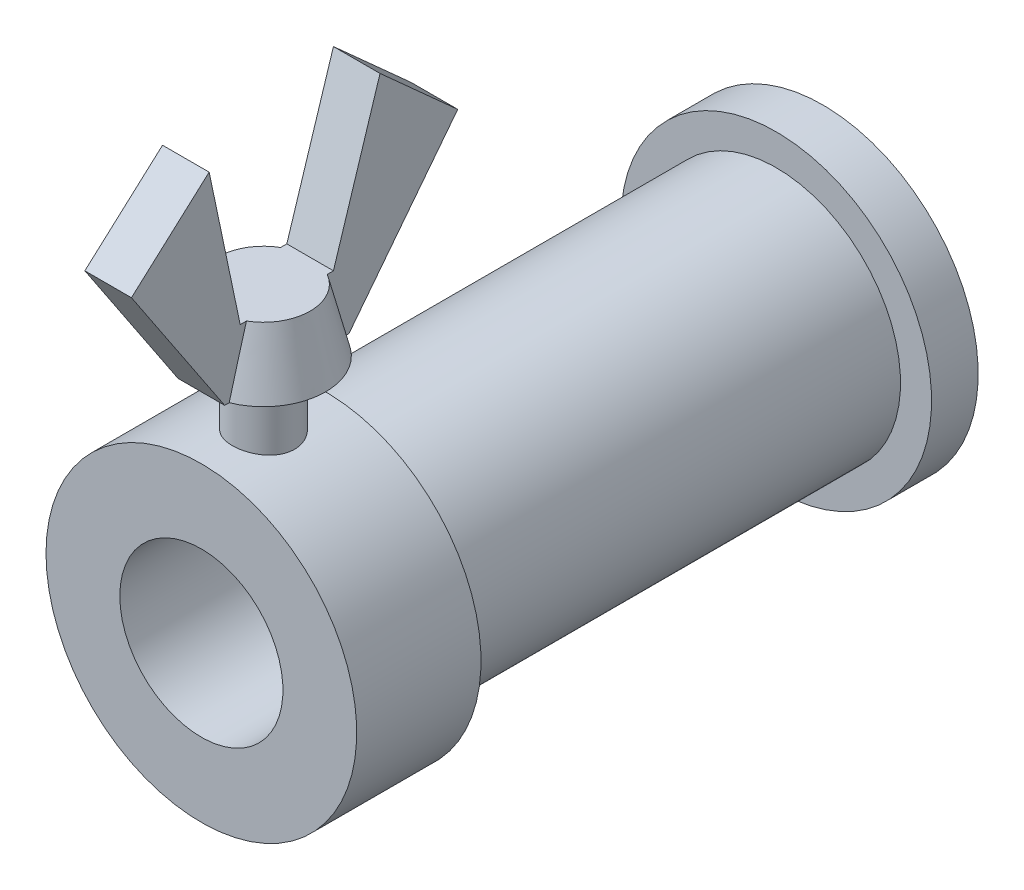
ISO-10303-21;
HEADER;
FILE_DESCRIPTION(('STEP AP214'),'2;1');
FILE_NAME('part.step','',(''),(''),'','','');
FILE_SCHEMA(('AUTOMOTIVE_DESIGN { 1 0 10303 214 1 1 1 1 }'));
ENDSEC;
DATA;
#1=APPLICATION_CONTEXT('core data for automotive mechanical design processes');
#2=APPLICATION_PROTOCOL_DEFINITION('international standard','automotive_design',2000,#1);
#3=PRODUCT_CONTEXT('',#1,'mechanical');
#4=PRODUCT('Part','Part','',(#3));
#5=PRODUCT_RELATED_PRODUCT_CATEGORY('part','',(#4));
#6=PRODUCT_DEFINITION_FORMATION('','',#4);
#7=PRODUCT_DEFINITION_CONTEXT('part definition',#1,'design');
#8=PRODUCT_DEFINITION('design','',#6,#7);
#9=PRODUCT_DEFINITION_SHAPE('','',#8);
#10=(LENGTH_UNIT() NAMED_UNIT(*) SI_UNIT(.MILLI.,.METRE.));
#11=(NAMED_UNIT(*) PLANE_ANGLE_UNIT() SI_UNIT($,.RADIAN.));
#12=(NAMED_UNIT(*) SI_UNIT($,.STERADIAN.) SOLID_ANGLE_UNIT());
#13=UNCERTAINTY_MEASURE_WITH_UNIT(LENGTH_MEASURE(1.E-05),#10,'distance_accuracy_value','');
#14=(GEOMETRIC_REPRESENTATION_CONTEXT(3) GLOBAL_UNCERTAINTY_ASSIGNED_CONTEXT((#13)) GLOBAL_UNIT_ASSIGNED_CONTEXT((#10,
#11,#12)) REPRESENTATION_CONTEXT('',''));
#15=CARTESIAN_POINT('',(0.,0.,0.));
#16=DIRECTION('',(0.,0.,1.));
#17=DIRECTION('',(1.,0.,0.));
#18=AXIS2_PLACEMENT_3D('',#15,#16,#17);
#19=CARTESIAN_POINT('',(0.,18.,36.));
#20=DIRECTION('',(0.,-1.,0.));
#21=DIRECTION('',(0.,0.,1.));
#22=AXIS2_PLACEMENT_3D('',#19,#20,#21);
#23=CONICAL_SURFACE('',#22,3.,0.244978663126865);
#24=CARTESIAN_POINT('',(-1.5,20.8634565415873,37.7225784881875));
#25=CARTESIAN_POINT('',(-1.5,20.7179564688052,37.7707943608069));
#26=CARTESIAN_POINT('',(-1.5,20.5722086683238,37.8182542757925));
#27=CARTESIAN_POINT('',(-1.5,20.2803109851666,37.9119099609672));
#28=CARTESIAN_POINT('',(-1.5,20.13416111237,37.9581057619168));
#29=CARTESIAN_POINT('',(-1.5,19.8415562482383,38.0494799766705));
#30=CARTESIAN_POINT('',(-1.5,19.6951012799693,38.0946584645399));
#31=CARTESIAN_POINT('',(-1.5,19.401932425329,38.1841702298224));
#32=CARTESIAN_POINT('',(-1.5,19.2552185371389,38.2285035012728));
#33=CARTESIAN_POINT('',(-1.5,18.8148083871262,38.3604319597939));
#34=CARTESIAN_POINT('',(-1.5,18.5207956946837,38.4469706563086));
#35=CARTESIAN_POINT('',(-1.5,17.9321710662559,38.617999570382));
#36=CARTESIAN_POINT('',(-1.5,17.6375591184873,38.7024897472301));
#37=CARTESIAN_POINT('',(-1.5,17.1572394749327,38.8388644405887));
#38=CARTESIAN_POINT('',(-1.5,16.9716653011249,38.8912200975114));
#39=CARTESIAN_POINT('',(-1.5,16.6003702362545,38.995403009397));
#40=CARTESIAN_POINT('',(-1.5,16.4146493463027,39.0472302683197));
#41=CARTESIAN_POINT('',(-1.5,15.8572788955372,39.2020403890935));
#42=CARTESIAN_POINT('',(-1.5,15.4854412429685,39.3043460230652));
#43=CARTESIAN_POINT('',(-1.5,14.6318117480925,39.5375328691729));
#44=CARTESIAN_POINT('',(-1.5,14.1498946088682,39.6679546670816));
#45=CARTESIAN_POINT('',(-1.5,13.1856155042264,39.9271461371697));
#46=CARTESIAN_POINT('',(-1.5,12.7032535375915,40.0559158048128));
#47=CARTESIAN_POINT('',(-1.5,11.7382755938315,40.3121964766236));
#48=CARTESIAN_POINT('',(-1.5,11.2556596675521,40.439707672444));
#49=CARTESIAN_POINT('',(-1.5,10.2901756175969,40.6937568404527));
#50=CARTESIAN_POINT('',(-1.5,9.80730749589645,40.8202948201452));
#51=CARTESIAN_POINT('',(-1.5,9.32434773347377,40.9464797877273));
#52=B_SPLINE_CURVE_WITH_KNOTS('',3,(#24,#25,#26,#27,#28,#29,#30,#31,#32,#33,#34,#35,#36,#37,#38,
#39,#40,#41,#42,#43,#44,#45,#46,#47,#48,#49,#50,#51),.UNSPECIFIED.,.F.,.F.,(4,2,2,2,2,2,2,2,2,2,
2,2,2,4),(0.,0.459836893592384,0.919662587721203,1.37945469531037,1.83925004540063,
2.75869016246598,3.67814853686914,4.25660258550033,4.83505229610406,5.99201310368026,
7.4897692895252,8.9875295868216,10.4850581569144,11.982575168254),.UNSPECIFIED.);
#53=CARTESIAN_POINT('',(-1.5,18.,38.5980762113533));
#54=VERTEX_POINT('',#53);
#55=CARTESIAN_POINT('',(-1.5,14.,39.7080992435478));
#56=VERTEX_POINT('',#55);
#57=EDGE_CURVE('E308',#54,#56,#52,.T.);
#58=ORIENTED_EDGE('',*,*,#57,.F.);
#59=CARTESIAN_POINT('',(0.,18.,36.));
#60=DIRECTION('',(0.,-1.,0.));
#61=DIRECTION('',(0.,0.,1.));
#62=AXIS2_PLACEMENT_3D('',#59,#60,#61);
#63=CIRCLE('',#62,3.);
#64=CARTESIAN_POINT('',(-1.5,18.,33.4019237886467));
#65=VERTEX_POINT('',#64);
#66=EDGE_CURVE('E176',#54,#65,#63,.T.);
#67=ORIENTED_EDGE('',*,*,#66,.T.);
#68=CARTESIAN_POINT('',(-1.5,9.32434773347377,31.0535202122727));
#69=CARTESIAN_POINT('',(-1.5,9.80738804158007,31.1797262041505));
#70=CARTESIAN_POINT('',(-1.5,10.2903366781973,31.3062853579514));
#71=CARTESIAN_POINT('',(-1.5,11.2559717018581,31.5603746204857));
#72=CARTESIAN_POINT('',(-1.5,11.7386580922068,31.6879047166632));
#73=CARTESIAN_POINT('',(-1.5,12.7036262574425,31.9441835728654));
#74=CARTESIAN_POINT('',(-1.5,13.1859080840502,32.0729321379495));
#75=CARTESIAN_POINT('',(-1.5,14.1500361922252,32.3320837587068));
#76=CARTESIAN_POINT('',(-1.5,14.6318824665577,32.4624868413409));
#77=CARTESIAN_POINT('',(-1.5,15.5950544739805,32.7255967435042));
#78=CARTESIAN_POINT('',(-1.5,16.0763800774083,32.8583040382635));
#79=CARTESIAN_POINT('',(-1.5,17.038107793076,33.12697047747));
#80=CARTESIAN_POINT('',(-1.5,17.5185099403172,33.2629294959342));
#81=CARTESIAN_POINT('',(-1.5,18.2380729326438,33.4706495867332));
#82=CARTESIAN_POINT('',(-1.5,18.4777770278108,33.5405268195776));
#83=CARTESIAN_POINT('',(-1.5,18.9567027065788,33.6819038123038));
#84=CARTESIAN_POINT('',(-1.5,19.1959242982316,33.7534035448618));
#85=CARTESIAN_POINT('',(-1.5,19.6737573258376,33.898533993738));
#86=CARTESIAN_POINT('',(-1.5,19.9123686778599,33.972164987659));
#87=CARTESIAN_POINT('',(-1.5,20.2696087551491,34.0847837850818));
#88=CARTESIAN_POINT('',(-1.5,20.3885793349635,34.1226865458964));
#89=CARTESIAN_POINT('',(-1.5,20.62624120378,34.199363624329));
#90=CARTESIAN_POINT('',(-1.5,20.7449324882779,34.2381379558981));
#91=CARTESIAN_POINT('',(-1.5,20.8634565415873,34.2774215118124));
#92=B_SPLINE_CURVE_WITH_KNOTS('',3,(#68,#69,#70,#71,#72,#73,#74,#75,#76,#77,#78,#79,#80,#81,#82,
#83,#84,#85,#86,#87,#88,#89,#90,#91),.UNSPECIFIED.,.F.,.F.,(4,2,2,2,2,2,2,2,2,2,2,4),(0.,
1.49776676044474,2.99551418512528,4.49302590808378,5.99056206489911,7.48841083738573,
8.98620167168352,9.73524200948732,10.4842697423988,11.2333954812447,11.6079796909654,
11.9825699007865),.UNSPECIFIED.);
#93=CARTESIAN_POINT('',(-1.5,14.,32.2919007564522));
#94=VERTEX_POINT('',#93);
#95=EDGE_CURVE('E205',#94,#65,#92,.T.);
#96=ORIENTED_EDGE('',*,*,#95,.F.);
#97=CARTESIAN_POINT('',(0.,14.,36.));
#98=DIRECTION('',(0.,-1.,0.));
#99=DIRECTION('',(0.,0.,1.));
#100=AXIS2_PLACEMENT_3D('',#97,#98,#99);
#101=CIRCLE('',#100,4.);
#102=EDGE_CURVE('E174',#56,#94,#101,.T.);
#103=ORIENTED_EDGE('',*,*,#102,.F.);
#104=EDGE_LOOP('',(#58,#67,#96,#103));
#105=FACE_BOUND('',#104,.T.);
#106=ADVANCED_FACE('F14',(#105),#23,.T.);
#107=CARTESIAN_POINT('',(-10.,0.,0.));
#108=DIRECTION('',(0.,0.,1.));
#109=DIRECTION('',(1.,0.,0.));
#110=AXIS2_PLACEMENT_3D('',#107,#108,#109);
#111=PLANE('',#110);
#112=CARTESIAN_POINT('',(0.,0.,0.));
#113=DIRECTION('',(0.,0.,-1.));
#114=DIRECTION('',(-1.,0.,0.));
#115=AXIS2_PLACEMENT_3D('',#112,#113,#114);
#116=CIRCLE('',#115,5.25);
#117=CARTESIAN_POINT('',(-5.25,0.,0.));
#118=VERTEX_POINT('',#117);
#119=EDGE_CURVE('E181',#118,#118,#116,.T.);
#120=ORIENTED_EDGE('',*,*,#119,.F.);
#121=EDGE_LOOP('',(#120));
#122=FACE_BOUND('',#121,.T.);
#123=CARTESIAN_POINT('',(0.,0.,0.));
#124=DIRECTION('',(0.,0.,-1.));
#125=DIRECTION('',(-1.,0.,0.));
#126=AXIS2_PLACEMENT_3D('',#123,#124,#125);
#127=CIRCLE('',#126,10.);
#128=CARTESIAN_POINT('',(-10.,0.,0.));
#129=VERTEX_POINT('',#128);
#130=EDGE_CURVE('E202',#129,#129,#127,.T.);
#131=ORIENTED_EDGE('',*,*,#130,.T.);
#132=EDGE_LOOP('',(#131));
#133=FACE_BOUND('',#132,.T.);
#134=ADVANCED_FACE('F16',(#122,#133),#111,.F.);
#135=CARTESIAN_POINT('',(0.,0.,-20.));
#136=DIRECTION('',(0.,0.,-1.));
#137=DIRECTION('',(-1.,0.,0.));
#138=AXIS2_PLACEMENT_3D('',#135,#136,#137);
#139=CYLINDRICAL_SURFACE('',#138,10.);
#140=ORIENTED_EDGE('',*,*,#130,.F.);
#141=EDGE_LOOP('',(#140));
#142=FACE_BOUND('',#141,.T.);
#143=CARTESIAN_POINT('',(0.,0.,3.));
#144=DIRECTION('',(0.,0.,-1.));
#145=DIRECTION('',(-1.,0.,0.));
#146=AXIS2_PLACEMENT_3D('',#143,#144,#145);
#147=CIRCLE('',#146,10.);
#148=CARTESIAN_POINT('',(-10.,0.,3.));
#149=VERTEX_POINT('',#148);
#150=EDGE_CURVE('E199',#149,#149,#147,.T.);
#151=ORIENTED_EDGE('',*,*,#150,.T.);
#152=EDGE_LOOP('',(#151));
#153=FACE_BOUND('',#152,.T.);
#154=ADVANCED_FACE('F254',(#142,#153),#139,.T.);
#155=CARTESIAN_POINT('',(-8.,0.,3.));
#156=DIRECTION('',(0.,0.,-1.));
#157=DIRECTION('',(-1.,0.,0.));
#158=AXIS2_PLACEMENT_3D('',#155,#156,#157);
#159=PLANE('',#158);
#160=ORIENTED_EDGE('',*,*,#150,.F.);
#161=EDGE_LOOP('',(#160));
#162=FACE_BOUND('',#161,.T.);
#163=CARTESIAN_POINT('',(0.,0.,3.));
#164=DIRECTION('',(0.,0.,-1.));
#165=DIRECTION('',(-1.,0.,0.));
#166=AXIS2_PLACEMENT_3D('',#163,#164,#165);
#167=CIRCLE('',#166,8.);
#168=CARTESIAN_POINT('',(-8.,0.,3.));
#169=VERTEX_POINT('',#168);
#170=EDGE_CURVE('E196',#169,#169,#167,.T.);
#171=ORIENTED_EDGE('',*,*,#170,.T.);
#172=EDGE_LOOP('',(#171));
#173=FACE_BOUND('',#172,.T.);
#174=ADVANCED_FACE('F434',(#162,#173),#159,.F.);
#175=CARTESIAN_POINT('',(0.,0.,-20.));
#176=DIRECTION('',(0.,0.,-1.));
#177=DIRECTION('',(-1.,0.,0.));
#178=AXIS2_PLACEMENT_3D('',#175,#176,#177);
#179=CYLINDRICAL_SURFACE('',#178,8.);
#180=ORIENTED_EDGE('',*,*,#170,.F.);
#181=EDGE_LOOP('',(#180));
#182=FACE_BOUND('',#181,.T.);
#183=CARTESIAN_POINT('',(0.,0.,32.));
#184=DIRECTION('',(0.,0.,-1.));
#185=DIRECTION('',(-1.,0.,0.));
#186=AXIS2_PLACEMENT_3D('',#183,#184,#185);
#187=CIRCLE('',#186,8.);
#188=CARTESIAN_POINT('',(-8.,0.,32.));
#189=VERTEX_POINT('',#188);
#190=EDGE_CURVE('E193',#189,#189,#187,.T.);
#191=ORIENTED_EDGE('',*,*,#190,.T.);
#192=EDGE_LOOP('',(#191));
#193=FACE_BOUND('',#192,.T.);
#194=ADVANCED_FACE('F425',(#182,#193),#179,.T.);
#195=CARTESIAN_POINT('',(-10.,0.,32.));
#196=DIRECTION('',(0.,0.,1.));
#197=DIRECTION('',(1.,0.,0.));
#198=AXIS2_PLACEMENT_3D('',#195,#196,#197);
#199=PLANE('',#198);
#200=ORIENTED_EDGE('',*,*,#190,.F.);
#201=EDGE_LOOP('',(#200));
#202=FACE_BOUND('',#201,.T.);
#203=CARTESIAN_POINT('',(0.,0.,32.));
#204=DIRECTION('',(0.,0.,-1.));
#205=DIRECTION('',(-1.,0.,0.));
#206=AXIS2_PLACEMENT_3D('',#203,#204,#205);
#207=CIRCLE('',#206,10.);
#208=CARTESIAN_POINT('',(-10.,0.,32.));
#209=VERTEX_POINT('',#208);
#210=EDGE_CURVE('E190',#209,#209,#207,.T.);
#211=ORIENTED_EDGE('',*,*,#210,.T.);
#212=EDGE_LOOP('',(#211));
#213=FACE_BOUND('',#212,.T.);
#214=ADVANCED_FACE('F244',(#202,#213),#199,.F.);
#215=CARTESIAN_POINT('',(0.,0.,-20.));
#216=DIRECTION('',(0.,0.,-1.));
#217=DIRECTION('',(-1.,0.,0.));
#218=AXIS2_PLACEMENT_3D('',#215,#216,#217);
#219=CYLINDRICAL_SURFACE('',#218,10.);
#220=CARTESIAN_POINT('',(0.,10.,38.));
#221=CARTESIAN_POINT('',(-0.111153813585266,9.99999795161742,37.9999959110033));
#222=CARTESIAN_POINT('',(-0.222359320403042,9.99812770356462,37.9907023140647));
#223=CARTESIAN_POINT('',(-0.441627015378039,9.99084731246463,37.9538029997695));
#224=CARTESIAN_POINT('',(-0.549686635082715,9.98543435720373,37.926182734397));
#225=CARTESIAN_POINT('',(-0.759460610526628,9.97167298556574,37.8535174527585));
#226=CARTESIAN_POINT('',(-0.861180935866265,9.96332738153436,37.8084891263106));
#227=CARTESIAN_POINT('',(-1.05561597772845,9.94460796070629,37.7023355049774));
#228=CARTESIAN_POINT('',(-1.14833123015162,9.93423426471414,37.6412111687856));
#229=CARTESIAN_POINT('',(-1.32338695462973,9.9124433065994,37.5037230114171));
#230=CARTESIAN_POINT('',(-1.40558790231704,9.90101491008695,37.4271832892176));
#231=CARTESIAN_POINT('',(-1.55607351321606,9.87848360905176,37.2614151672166));
#232=CARTESIAN_POINT('',(-1.62435708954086,9.86738073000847,37.1721857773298));
#233=CARTESIAN_POINT('',(-1.74566350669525,9.8466488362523,36.9825676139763));
#234=CARTESIAN_POINT('',(-1.79854187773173,9.83703414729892,36.8820847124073));
#235=CARTESIAN_POINT('',(-1.88661133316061,9.82052536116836,36.6734363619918));
#236=CARTESIAN_POINT('',(-1.92180416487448,9.81363099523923,36.5652716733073));
#237=CARTESIAN_POINT('',(-1.97305059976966,9.80345610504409,36.3458312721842));
#238=CARTESIAN_POINT('',(-1.98934899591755,9.80012940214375,36.2346149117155));
#239=CARTESIAN_POINT('',(-2.00310425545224,9.79732750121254,36.0109803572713));
#240=CARTESIAN_POINT('',(-2.00056304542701,9.79785190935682,35.8985622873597));
#241=CARTESIAN_POINT('',(-1.97690914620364,9.80265102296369,35.677506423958));
#242=CARTESIAN_POINT('',(-1.95607708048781,9.80686905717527,35.5688371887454));
#243=CARTESIAN_POINT('',(-1.8968757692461,9.81849092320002,35.356567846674));
#244=CARTESIAN_POINT('',(-1.85850568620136,9.82589490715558,35.252967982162));
#245=CARTESIAN_POINT('',(-1.76504956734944,9.84311237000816,35.0529694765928));
#246=CARTESIAN_POINT('',(-1.70985230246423,9.85294179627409,34.9566242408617));
#247=CARTESIAN_POINT('',(-1.58438714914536,9.87389237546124,34.7744583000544));
#248=CARTESIAN_POINT('',(-1.51411752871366,9.88501367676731,34.6886388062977));
#249=CARTESIAN_POINT('',(-1.35899986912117,9.90754042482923,34.5283411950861));
#250=CARTESIAN_POINT('',(-1.27391232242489,9.9189473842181,34.4540948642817));
#251=CARTESIAN_POINT('',(-1.09237004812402,9.94057697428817,34.3208923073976));
#252=CARTESIAN_POINT('',(-0.995915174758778,9.95079958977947,34.2619362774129));
#253=CARTESIAN_POINT('',(-0.794118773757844,9.96893380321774,34.1609449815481));
#254=CARTESIAN_POINT('',(-0.688763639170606,9.97684177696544,34.1189362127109));
#255=CARTESIAN_POINT('',(-0.472297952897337,9.98942817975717,34.0532790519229));
#256=CARTESIAN_POINT('',(-0.361188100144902,9.99410700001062,34.0296284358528));
#257=CARTESIAN_POINT('',(-0.138358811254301,9.99965343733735,34.0016870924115));
#258=CARTESIAN_POINT('',(-0.0266806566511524,10.0005834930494,33.9970791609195));
#259=CARTESIAN_POINT('',(0.195849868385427,9.99870103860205,34.0064997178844));
#260=CARTESIAN_POINT('',(0.306702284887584,9.99588873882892,34.0205271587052));
#261=CARTESIAN_POINT('',(0.523411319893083,9.98687664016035,34.0665567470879));
#262=CARTESIAN_POINT('',(0.629303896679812,9.98070752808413,34.0983961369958));
#263=CARTESIAN_POINT('',(0.834247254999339,9.96567104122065,34.1789679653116));
#264=CARTESIAN_POINT('',(0.933297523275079,9.95680346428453,34.2277016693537));
#265=CARTESIAN_POINT('',(1.12308234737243,9.93719823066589,34.3413649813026));
#266=CARTESIAN_POINT('',(1.21370025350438,9.92643900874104,34.4064855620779));
#267=CARTESIAN_POINT('',(1.38283603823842,9.90429469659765,34.5508183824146));
#268=CARTESIAN_POINT('',(1.46135261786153,9.89290953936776,34.6300321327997));
#269=CARTESIAN_POINT('',(1.60528118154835,9.8705860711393,34.8017467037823));
#270=CARTESIAN_POINT('',(1.67047540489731,9.85965720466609,34.8944314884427));
#271=CARTESIAN_POINT('',(1.78437084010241,9.83968383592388,35.0896227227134));
#272=CARTESIAN_POINT('',(1.83307271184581,9.83063925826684,35.1921287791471));
#273=CARTESIAN_POINT('',(1.91230368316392,9.81553481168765,35.4035364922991));
#274=CARTESIAN_POINT('',(1.9429269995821,9.80945949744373,35.5124016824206));
#275=CARTESIAN_POINT('',(1.98541730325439,9.80094873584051,35.7338669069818));
#276=CARTESIAN_POINT('',(1.99728673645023,9.79851281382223,35.8464664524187));
#277=CARTESIAN_POINT('',(2.00184182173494,9.79758299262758,36.0700177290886));
#278=CARTESIAN_POINT('',(1.99487157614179,9.79901838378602,36.180962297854));
#279=CARTESIAN_POINT('',(1.96270460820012,9.80551146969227,36.4000632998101));
#280=CARTESIAN_POINT('',(1.9375080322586,9.81056913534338,36.5082197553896));
#281=CARTESIAN_POINT('',(1.86975713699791,9.82370528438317,36.7184554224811));
#282=CARTESIAN_POINT('',(1.82724501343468,9.83177642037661,36.8205487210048));
#283=CARTESIAN_POINT('',(1.72610928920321,9.8500342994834,37.0162074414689));
#284=CARTESIAN_POINT('',(1.66748433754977,9.86022121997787,37.1097721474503));
#285=CARTESIAN_POINT('',(1.53461182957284,9.8817792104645,37.2874311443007));
#286=CARTESIAN_POINT('',(1.46011577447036,9.89316745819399,37.3713375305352));
#287=CARTESIAN_POINT('',(1.29812873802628,9.91572163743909,37.5255724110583));
#288=CARTESIAN_POINT('',(1.21063477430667,9.92688751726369,37.5958977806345));
#289=CARTESIAN_POINT('',(1.0240352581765,9.94787664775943,37.7216692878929));
#290=CARTESIAN_POINT('',(0.924817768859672,9.95768462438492,37.7769520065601));
#291=CARTESIAN_POINT('',(0.718332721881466,9.9747025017,37.8699722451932));
#292=CARTESIAN_POINT('',(0.611072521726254,9.98191474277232,37.907725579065));
#293=CARTESIAN_POINT('',(0.419642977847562,9.99152745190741,37.9573038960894));
#294=CARTESIAN_POINT('',(0.336563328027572,9.99468606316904,37.9732863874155));
#295=CARTESIAN_POINT('',(0.168999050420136,9.99892308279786,37.9946358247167));
#296=CARTESIAN_POINT('',(0.0845144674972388,10.0000015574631,38.0000031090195));
#297=CARTESIAN_POINT('',(0.,10.,38.));
#298=B_SPLINE_CURVE_WITH_KNOTS('',3,(#220,#221,#222,#223,#224,#225,#226,#227,#228,#229,#230,
#231,#232,#233,#234,#235,#236,#237,#238,#239,#240,#241,#242,#243,#244,#245,#246,#247,#248,#249,
#250,#251,#252,#253,#254,#255,#256,#257,#258,#259,#260,#261,#262,#263,#264,#265,#266,#267,#268,
#269,#270,#271,#272,#273,#274,#275,#276,#277,#278,#279,#280,#281,#282,#283,#284,#285,#286,#287,
#288,#289,#290,#291,#292,#293,#294,#295,#296,#297),.UNSPECIFIED.,.T.,.F.,(4,2,2,2,2,2,2,2,2,2,2,
2,2,2,2,2,2,2,2,2,2,2,2,2,2,2,2,2,2,2,2,2,2,2,2,2,2,2,4),(0.,0.333152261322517,
0.666569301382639,0.999667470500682,1.33274580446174,1.66986534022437,2.00701119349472,
2.34722390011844,2.68740298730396,3.02312370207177,3.35881008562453,3.68943454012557,
4.02007478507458,4.35294980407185,4.68586309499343,5.02476504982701,5.3636713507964,
5.70310549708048,6.04249851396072,6.37621471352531,6.70991215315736,7.04060907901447,
7.37133078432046,7.70610132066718,8.04090776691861,8.3808125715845,8.72070377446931,
9.05880762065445,9.39686736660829,9.72879445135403,10.0607188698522,10.3918392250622,
10.7229873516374,11.0597615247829,11.3966130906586,11.7369899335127,12.0770591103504,
12.3303755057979,12.5836838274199),.UNSPECIFIED.);
#299=CARTESIAN_POINT('',(0.,10.,38.));
#300=VERTEX_POINT('',#299);
#301=EDGE_CURVE('E180',#300,#300,#298,.T.);
#302=ORIENTED_EDGE('',*,*,#301,.T.);
#303=EDGE_LOOP('',(#302));
#304=FACE_BOUND('',#303,.T.);
#305=ORIENTED_EDGE('',*,*,#210,.F.);
#306=EDGE_LOOP('',(#305));
#307=FACE_BOUND('',#306,.T.);
#308=CARTESIAN_POINT('',(0.,0.,40.));
#309=DIRECTION('',(0.,0.,-1.));
#310=DIRECTION('',(-1.,0.,0.));
#311=AXIS2_PLACEMENT_3D('',#308,#309,#310);
#312=CIRCLE('',#311,10.);
#313=CARTESIAN_POINT('',(-10.,0.,40.));
#314=VERTEX_POINT('',#313);
#315=EDGE_CURVE('E187',#314,#314,#312,.T.);
#316=ORIENTED_EDGE('',*,*,#315,.T.);
#317=EDGE_LOOP('',(#316));
#318=FACE_BOUND('',#317,.T.);
#319=ADVANCED_FACE('F219',(#304,#307,#318),#219,.T.);
#320=CARTESIAN_POINT('',(-5.25,0.,40.));
#321=DIRECTION('',(0.,0.,-1.));
#322=DIRECTION('',(-1.,0.,0.));
#323=AXIS2_PLACEMENT_3D('',#320,#321,#322);
#324=PLANE('',#323);
#325=ORIENTED_EDGE('',*,*,#315,.F.);
#326=EDGE_LOOP('',(#325));
#327=FACE_BOUND('',#326,.T.);
#328=CARTESIAN_POINT('',(0.,0.,40.));
#329=DIRECTION('',(0.,0.,-1.));
#330=DIRECTION('',(-1.,0.,0.));
#331=AXIS2_PLACEMENT_3D('',#328,#329,#330);
#332=CIRCLE('',#331,5.25);
#333=CARTESIAN_POINT('',(-5.25,0.,40.));
#334=VERTEX_POINT('',#333);
#335=EDGE_CURVE('E184',#334,#334,#332,.T.);
#336=ORIENTED_EDGE('',*,*,#335,.T.);
#337=EDGE_LOOP('',(#336));
#338=FACE_BOUND('',#337,.T.);
#339=ADVANCED_FACE('F236',(#327,#338),#324,.F.);
#340=CARTESIAN_POINT('',(0.,0.,-20.));
#341=DIRECTION('',(0.,0.,-1.));
#342=DIRECTION('',(-1.,0.,0.));
#343=AXIS2_PLACEMENT_3D('',#340,#341,#342);
#344=CYLINDRICAL_SURFACE('',#343,5.25);
#345=ORIENTED_EDGE('',*,*,#335,.F.);
#346=EDGE_LOOP('',(#345));
#347=FACE_BOUND('',#346,.T.);
#348=ORIENTED_EDGE('',*,*,#119,.T.);
#349=EDGE_LOOP('',(#348));
#350=FACE_BOUND('',#349,.T.);
#351=ADVANCED_FACE('F229',(#347,#350),#344,.F.);
#352=CARTESIAN_POINT('',(0.,-40.,36.));
#353=DIRECTION('',(0.,-1.,0.));
#354=DIRECTION('',(0.,0.,1.));
#355=AXIS2_PLACEMENT_3D('',#352,#353,#354);
#356=CYLINDRICAL_SURFACE('',#355,2.);
#357=CARTESIAN_POINT('',(0.,14.,36.));
#358=DIRECTION('',(0.,-1.,0.));
#359=DIRECTION('',(0.,0.,1.));
#360=AXIS2_PLACEMENT_3D('',#357,#358,#359);
#361=CIRCLE('',#360,2.);
#362=CARTESIAN_POINT('',(0.,14.,38.));
#363=VERTEX_POINT('',#362);
#364=EDGE_CURVE('E177',#363,#363,#361,.T.);
#365=ORIENTED_EDGE('',*,*,#364,.T.);
#366=EDGE_LOOP('',(#365));
#367=FACE_BOUND('',#366,.T.);
#368=ORIENTED_EDGE('',*,*,#301,.F.);
#369=EDGE_LOOP('',(#368));
#370=FACE_BOUND('',#369,.T.);
#371=ADVANCED_FACE('F223',(#367,#370),#356,.T.);
#372=CARTESIAN_POINT('',(0.,14.,32.));
#373=DIRECTION('',(0.,1.,0.));
#374=DIRECTION('',(0.,0.,-1.));
#375=AXIS2_PLACEMENT_3D('',#372,#373,#374);
#376=PLANE('',#375);
#377=ORIENTED_EDGE('',*,*,#364,.F.);
#378=EDGE_LOOP('',(#377));
#379=FACE_BOUND('',#378,.T.);
#380=CARTESIAN_POINT('',(1.5,14.,32.2919007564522));
#381=VERTEX_POINT('',#380);
#382=CARTESIAN_POINT('',(1.5,14.,39.7080992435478));
#383=VERTEX_POINT('',#382);
#384=EDGE_CURVE('E116',#381,#383,#101,.T.);
#385=ORIENTED_EDGE('',*,*,#384,.T.);
#386=DIRECTION('',(0.,0.,1.));
#387=VECTOR('',#386,1.);
#388=CARTESIAN_POINT('',(1.5,14.,32.));
#389=LINE('',#388,#387);
#390=CARTESIAN_POINT('',(1.5,14.,40.));
#391=VERTEX_POINT('',#390);
#392=EDGE_CURVE('E132',#383,#391,#389,.T.);
#393=ORIENTED_EDGE('',*,*,#392,.T.);
#394=DIRECTION('',(1.,0.,0.));
#395=VECTOR('',#394,1.);
#396=CARTESIAN_POINT('',(-1.5,14.,40.));
#397=LINE('',#396,#395);
#398=CARTESIAN_POINT('',(-1.5,14.,40.));
#399=VERTEX_POINT('',#398);
#400=EDGE_CURVE('E167',#399,#391,#397,.T.);
#401=ORIENTED_EDGE('',*,*,#400,.F.);
#402=DIRECTION('',(0.,0.,1.));
#403=VECTOR('',#402,1.);
#404=CARTESIAN_POINT('',(-1.5,14.,32.));
#405=LINE('',#404,#403);
#406=EDGE_CURVE('E152',#56,#399,#405,.T.);
#407=ORIENTED_EDGE('',*,*,#406,.F.);
#408=ORIENTED_EDGE('',*,*,#102,.T.);
#409=CARTESIAN_POINT('',(-1.5,14.,32.));
#410=VERTEX_POINT('',#409);
#411=EDGE_CURVE('E149',#410,#94,#405,.T.);
#412=ORIENTED_EDGE('',*,*,#411,.F.);
#413=DIRECTION('',(1.,0.,0.));
#414=VECTOR('',#413,1.);
#415=CARTESIAN_POINT('',(-1.5,14.,32.));
#416=LINE('',#415,#414);
#417=CARTESIAN_POINT('',(1.5,14.,32.));
#418=VERTEX_POINT('',#417);
#419=EDGE_CURVE('E169',#410,#418,#416,.T.);
#420=ORIENTED_EDGE('',*,*,#419,.T.);
#421=EDGE_CURVE('E283',#418,#381,#389,.T.);
#422=ORIENTED_EDGE('',*,*,#421,.T.);
#423=EDGE_LOOP('',(#385,#393,#401,#407,#408,#412,#420,#422));
#424=FACE_BOUND('',#423,.T.);
#425=ADVANCED_FACE('F228',(#379,#424),#376,.F.);
#426=CARTESIAN_POINT('',(0.,18.,33.));
#427=DIRECTION('',(0.,1.,0.));
#428=DIRECTION('',(0.,0.,-1.));
#429=AXIS2_PLACEMENT_3D('',#426,#427,#428);
#430=PLANE('',#429);
#431=CARTESIAN_POINT('',(1.5,18.,33.4019237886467));
#432=VERTEX_POINT('',#431);
#433=CARTESIAN_POINT('',(1.5,18.,38.5980762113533));
#434=VERTEX_POINT('',#433);
#435=EDGE_CURVE('E34',#432,#434,#63,.T.);
#436=ORIENTED_EDGE('',*,*,#435,.F.);
#437=DIRECTION('',(0.,0.,1.));
#438=VECTOR('',#437,1.);
#439=CARTESIAN_POINT('',(1.5,18.,33.));
#440=LINE('',#439,#438);
#441=CARTESIAN_POINT('',(1.5,18.,33.));
#442=VERTEX_POINT('',#441);
#443=EDGE_CURVE('E159',#442,#432,#440,.T.);
#444=ORIENTED_EDGE('',*,*,#443,.F.);
#445=DIRECTION('',(1.,0.,0.));
#446=VECTOR('',#445,1.);
#447=CARTESIAN_POINT('',(-1.5,18.,33.));
#448=LINE('',#447,#446);
#449=CARTESIAN_POINT('',(-1.5,18.,33.));
#450=VERTEX_POINT('',#449);
#451=EDGE_CURVE('E122',#450,#442,#448,.T.);
#452=ORIENTED_EDGE('',*,*,#451,.F.);
#453=DIRECTION('',(0.,0.,1.));
#454=VECTOR('',#453,1.);
#455=CARTESIAN_POINT('',(-1.5,18.,33.));
#456=LINE('',#455,#454);
#457=EDGE_CURVE('E136',#450,#65,#456,.T.);
#458=ORIENTED_EDGE('',*,*,#457,.T.);
#459=ORIENTED_EDGE('',*,*,#66,.F.);
#460=CARTESIAN_POINT('',(-1.5,18.,39.));
#461=VERTEX_POINT('',#460);
#462=EDGE_CURVE('E139',#54,#461,#456,.T.);
#463=ORIENTED_EDGE('',*,*,#462,.T.);
#464=DIRECTION('',(1.,0.,0.));
#465=VECTOR('',#464,1.);
#466=CARTESIAN_POINT('',(-1.5,18.,39.));
#467=LINE('',#466,#465);
#468=CARTESIAN_POINT('',(1.5,18.,39.));
#469=VERTEX_POINT('',#468);
#470=EDGE_CURVE('E161',#461,#469,#467,.T.);
#471=ORIENTED_EDGE('',*,*,#470,.T.);
#472=EDGE_CURVE('E271',#434,#469,#440,.T.);
#473=ORIENTED_EDGE('',*,*,#472,.F.);
#474=EDGE_LOOP('',(#436,#444,#452,#458,#459,#463,#471,#473));
#475=FACE_BOUND('',#474,.T.);
#476=ADVANCED_FACE('F231',(#475),#430,.T.);
#477=ORIENTED_EDGE('',*,*,#435,.T.);
#478=CARTESIAN_POINT('',(1.5,20.8634565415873,37.7225784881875));
#479=CARTESIAN_POINT('',(1.5,20.7179564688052,37.7707943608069));
#480=CARTESIAN_POINT('',(1.5,20.5722086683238,37.8182542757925));
#481=CARTESIAN_POINT('',(1.5,20.2803109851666,37.9119099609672));
#482=CARTESIAN_POINT('',(1.5,20.13416111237,37.9581057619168));
#483=CARTESIAN_POINT('',(1.5,19.8415562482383,38.0494799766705));
#484=CARTESIAN_POINT('',(1.5,19.6951012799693,38.0946584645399));
#485=CARTESIAN_POINT('',(1.5,19.401932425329,38.1841702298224));
#486=CARTESIAN_POINT('',(1.5,19.2552185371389,38.2285035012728));
#487=CARTESIAN_POINT('',(1.5,18.8148083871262,38.3604319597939));
#488=CARTESIAN_POINT('',(1.5,18.5207956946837,38.4469706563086));
#489=CARTESIAN_POINT('',(1.5,17.9321710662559,38.617999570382));
#490=CARTESIAN_POINT('',(1.5,17.6375591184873,38.7024897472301));
#491=CARTESIAN_POINT('',(1.5,17.1572394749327,38.8388644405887));
#492=CARTESIAN_POINT('',(1.5,16.9716653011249,38.8912200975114));
#493=CARTESIAN_POINT('',(1.5,16.6003702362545,38.995403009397));
#494=CARTESIAN_POINT('',(1.5,16.4146493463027,39.0472302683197));
#495=CARTESIAN_POINT('',(1.5,15.8572788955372,39.2020403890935));
#496=CARTESIAN_POINT('',(1.5,15.4854412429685,39.3043460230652));
#497=CARTESIAN_POINT('',(1.5,14.6318117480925,39.5375328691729));
#498=CARTESIAN_POINT('',(1.5,14.1498946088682,39.6679546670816));
#499=CARTESIAN_POINT('',(1.5,13.1856155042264,39.9271461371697));
#500=CARTESIAN_POINT('',(1.5,12.7032535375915,40.0559158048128));
#501=CARTESIAN_POINT('',(1.5,11.7382755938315,40.3121964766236));
#502=CARTESIAN_POINT('',(1.5,11.2556596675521,40.439707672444));
#503=CARTESIAN_POINT('',(1.5,10.2901756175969,40.6937568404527));
#504=CARTESIAN_POINT('',(1.5,9.80730749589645,40.8202948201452));
#505=CARTESIAN_POINT('',(1.5,9.32434773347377,40.9464797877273));
#506=B_SPLINE_CURVE_WITH_KNOTS('',3,(#478,#479,#480,#481,#482,#483,#484,#485,#486,#487,#488,
#489,#490,#491,#492,#493,#494,#495,#496,#497,#498,#499,#500,#501,#502,#503,#504,#505),
.UNSPECIFIED.,.F.,.F.,(4,2,2,2,2,2,2,2,2,2,2,2,2,4),(0.,0.459836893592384,0.919662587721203,
1.37945469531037,1.83925004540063,2.75869016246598,3.67814853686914,4.25660258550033,
4.83505229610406,5.99201310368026,7.4897692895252,8.9875295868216,10.4850581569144,
11.982575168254),.UNSPECIFIED.);
#507=EDGE_CURVE('E9',#434,#383,#506,.T.);
#508=ORIENTED_EDGE('',*,*,#507,.T.);
#509=ORIENTED_EDGE('',*,*,#384,.F.);
#510=CARTESIAN_POINT('',(1.5,9.32434773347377,31.0535202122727));
#511=CARTESIAN_POINT('',(1.5,9.80738804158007,31.1797262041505));
#512=CARTESIAN_POINT('',(1.5,10.2903366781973,31.3062853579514));
#513=CARTESIAN_POINT('',(1.5,11.2559717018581,31.5603746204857));
#514=CARTESIAN_POINT('',(1.5,11.7386580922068,31.6879047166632));
#515=CARTESIAN_POINT('',(1.5,12.7036262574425,31.9441835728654));
#516=CARTESIAN_POINT('',(1.5,13.1859080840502,32.0729321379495));
#517=CARTESIAN_POINT('',(1.5,14.1500361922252,32.3320837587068));
#518=CARTESIAN_POINT('',(1.5,14.6318824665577,32.4624868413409));
#519=CARTESIAN_POINT('',(1.5,15.5950544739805,32.7255967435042));
#520=CARTESIAN_POINT('',(1.5,16.0763800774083,32.8583040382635));
#521=CARTESIAN_POINT('',(1.5,17.038107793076,33.12697047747));
#522=CARTESIAN_POINT('',(1.5,17.5185099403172,33.2629294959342));
#523=CARTESIAN_POINT('',(1.5,18.2380729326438,33.4706495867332));
#524=CARTESIAN_POINT('',(1.5,18.4777770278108,33.5405268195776));
#525=CARTESIAN_POINT('',(1.5,18.9567027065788,33.6819038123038));
#526=CARTESIAN_POINT('',(1.5,19.1959242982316,33.7534035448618));
#527=CARTESIAN_POINT('',(1.5,19.6737573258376,33.898533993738));
#528=CARTESIAN_POINT('',(1.5,19.9123686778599,33.972164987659));
#529=CARTESIAN_POINT('',(1.5,20.2696087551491,34.0847837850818));
#530=CARTESIAN_POINT('',(1.5,20.3885793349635,34.1226865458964));
#531=CARTESIAN_POINT('',(1.5,20.62624120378,34.199363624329));
#532=CARTESIAN_POINT('',(1.5,20.7449324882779,34.2381379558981));
#533=CARTESIAN_POINT('',(1.5,20.8634565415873,34.2774215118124));
#534=B_SPLINE_CURVE_WITH_KNOTS('',3,(#510,#511,#512,#513,#514,#515,#516,#517,#518,#519,#520,
#521,#522,#523,#524,#525,#526,#527,#528,#529,#530,#531,#532,#533),.UNSPECIFIED.,.F.,.F.,(4,2,2,
2,2,2,2,2,2,2,2,4),(0.,1.49776676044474,2.99551418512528,4.49302590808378,5.99056206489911,
7.48841083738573,8.98620167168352,9.73524200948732,10.4842697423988,11.2333954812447,
11.6079796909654,11.9825699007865),.UNSPECIFIED.);
#535=EDGE_CURVE('E28',#381,#432,#534,.T.);
#536=ORIENTED_EDGE('',*,*,#535,.T.);
#537=EDGE_LOOP('',(#477,#508,#509,#536));
#538=FACE_BOUND('',#537,.T.);
#539=ADVANCED_FACE('F250',(#538),#23,.T.);
#540=CARTESIAN_POINT('',(-1.5,14.,32.));
#541=DIRECTION('',(0.,-0.61394061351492,-0.789352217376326));
#542=DIRECTION('',(0.,-0.789352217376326,0.61394061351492));
#543=AXIS2_PLACEMENT_3D('',#540,#541,#542);
#544=PLANE('',#543);
#545=ORIENTED_EDGE('',*,*,#419,.F.);
#546=DIRECTION('',(0.,0.789352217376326,-0.61394061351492));
#547=VECTOR('',#546,1.);
#548=CARTESIAN_POINT('',(-1.5,14.,32.));
#549=LINE('',#548,#547);
#550=CARTESIAN_POINT('',(-1.5,23.,25.));
#551=VERTEX_POINT('',#550);
#552=EDGE_CURVE('E153',#410,#551,#549,.T.);
#553=ORIENTED_EDGE('',*,*,#552,.T.);
#554=DIRECTION('',(1.,0.,0.));
#555=VECTOR('',#554,1.);
#556=CARTESIAN_POINT('',(-1.5,23.,25.));
#557=LINE('',#556,#555);
#558=CARTESIAN_POINT('',(1.5,23.,25.));
#559=VERTEX_POINT('',#558);
#560=EDGE_CURVE('E117',#551,#559,#557,.T.);
#561=ORIENTED_EDGE('',*,*,#560,.T.);
#562=DIRECTION('',(0.,0.789352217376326,-0.61394061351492));
#563=VECTOR('',#562,1.);
#564=CARTESIAN_POINT('',(1.5,14.,32.));
#565=LINE('',#564,#563);
#566=EDGE_CURVE('E130',#418,#559,#565,.T.);
#567=ORIENTED_EDGE('',*,*,#566,.F.);
#568=EDGE_LOOP('',(#545,#553,#561,#567));
#569=FACE_BOUND('',#568,.T.);
#570=ADVANCED_FACE('F259',(#569),#544,.T.);
#571=CARTESIAN_POINT('',(-1.5,23.,25.));
#572=DIRECTION('',(0.,0.743294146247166,-0.66896473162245));
#573=DIRECTION('',(0.,-0.66896473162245,-0.743294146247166));
#574=AXIS2_PLACEMENT_3D('',#571,#572,#573);
#575=PLANE('',#574);
#576=ORIENTED_EDGE('',*,*,#560,.F.);
#577=DIRECTION('',(0.,0.66896473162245,0.743294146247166));
#578=VECTOR('',#577,1.);
#579=CARTESIAN_POINT('',(-1.5,23.,25.));
#580=LINE('',#579,#578);
#581=CARTESIAN_POINT('',(-1.5,27.5,30.));
#582=VERTEX_POINT('',#581);
#583=EDGE_CURVE('E112',#551,#582,#580,.T.);
#584=ORIENTED_EDGE('',*,*,#583,.T.);
#585=DIRECTION('',(1.,0.,0.));
#586=VECTOR('',#585,1.);
#587=CARTESIAN_POINT('',(-1.5,27.5,30.));
#588=LINE('',#587,#586);
#589=CARTESIAN_POINT('',(1.5,27.5,30.));
#590=VERTEX_POINT('',#589);
#591=EDGE_CURVE('E105',#582,#590,#588,.T.);
#592=ORIENTED_EDGE('',*,*,#591,.T.);
#593=DIRECTION('',(0.,0.66896473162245,0.743294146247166));
#594=VECTOR('',#593,1.);
#595=CARTESIAN_POINT('',(1.5,23.,25.));
#596=LINE('',#595,#594);
#597=EDGE_CURVE('E109',#559,#590,#596,.T.);
#598=ORIENTED_EDGE('',*,*,#597,.F.);
#599=EDGE_LOOP('',(#576,#584,#592,#598));
#600=FACE_BOUND('',#599,.T.);
#601=ADVANCED_FACE('F107',(#600),#575,.T.);
#602=CARTESIAN_POINT('',(1.5,14.,34.2631578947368));
#603=DIRECTION('',(1.,0.,0.));
#604=DIRECTION('',(0.,0.,-1.));
#605=AXIS2_PLACEMENT_3D('',#602,#603,#604);
#606=PLANE('',#605);
#607=ORIENTED_EDGE('',*,*,#535,.F.);
#608=ORIENTED_EDGE('',*,*,#421,.F.);
#609=ORIENTED_EDGE('',*,*,#566,.T.);
#610=ORIENTED_EDGE('',*,*,#597,.T.);
#611=DIRECTION('',(0.,0.953582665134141,-0.301131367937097));
#612=VECTOR('',#611,1.);
#613=CARTESIAN_POINT('',(1.5,18.,33.));
#614=LINE('',#613,#612);
#615=EDGE_CURVE('E120',#442,#590,#614,.T.);
#616=ORIENTED_EDGE('',*,*,#615,.F.);
#617=ORIENTED_EDGE('',*,*,#443,.T.);
#618=EDGE_LOOP('',(#607,#608,#609,#610,#616,#617));
#619=FACE_BOUND('',#618,.T.);
#620=ADVANCED_FACE('F127',(#619),#606,.T.);
#621=CARTESIAN_POINT('',(-1.5,18.,33.));
#622=DIRECTION('',(0.,-0.301131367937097,-0.953582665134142));
#623=DIRECTION('',(0.,-0.953582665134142,0.301131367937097));
#624=AXIS2_PLACEMENT_3D('',#621,#622,#623);
#625=PLANE('',#624);
#626=ORIENTED_EDGE('',*,*,#591,.F.);
#627=DIRECTION('',(0.,0.953582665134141,-0.301131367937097));
#628=VECTOR('',#627,1.);
#629=CARTESIAN_POINT('',(-1.5,18.,33.));
#630=LINE('',#629,#628);
#631=EDGE_CURVE('E157',#450,#582,#630,.T.);
#632=ORIENTED_EDGE('',*,*,#631,.F.);
#633=ORIENTED_EDGE('',*,*,#451,.T.);
#634=ORIENTED_EDGE('',*,*,#615,.T.);
#635=EDGE_LOOP('',(#626,#632,#633,#634));
#636=FACE_BOUND('',#635,.T.);
#637=ADVANCED_FACE('F121',(#636),#625,.F.);
#638=CARTESIAN_POINT('',(-1.5,14.,34.2631578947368));
#639=DIRECTION('',(1.,0.,0.));
#640=DIRECTION('',(0.,0.,-1.));
#641=AXIS2_PLACEMENT_3D('',#638,#639,#640);
#642=PLANE('',#641);
#643=ORIENTED_EDGE('',*,*,#411,.T.);
#644=ORIENTED_EDGE('',*,*,#95,.T.);
#645=ORIENTED_EDGE('',*,*,#457,.F.);
#646=ORIENTED_EDGE('',*,*,#631,.T.);
#647=ORIENTED_EDGE('',*,*,#583,.F.);
#648=ORIENTED_EDGE('',*,*,#552,.F.);
#649=EDGE_LOOP('',(#643,#644,#645,#646,#647,#648));
#650=FACE_BOUND('',#649,.T.);
#651=ADVANCED_FACE('F314',(#650),#642,.F.);
#652=ORIENTED_EDGE('',*,*,#507,.F.);
#653=ORIENTED_EDGE('',*,*,#472,.T.);
#654=DIRECTION('',(0.,0.978549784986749,0.206010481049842));
#655=VECTOR('',#654,1.);
#656=CARTESIAN_POINT('',(1.5,18.,39.));
#657=LINE('',#656,#655);
#658=CARTESIAN_POINT('',(1.5,27.5,41.));
#659=VERTEX_POINT('',#658);
#660=EDGE_CURVE('E274',#469,#659,#657,.T.);
#661=ORIENTED_EDGE('',*,*,#660,.T.);
#662=DIRECTION('',(0.,-0.66896473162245,0.743294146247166));
#663=VECTOR('',#662,1.);
#664=CARTESIAN_POINT('',(1.5,27.5,41.));
#665=LINE('',#664,#663);
#666=CARTESIAN_POINT('',(1.5,23.,46.));
#667=VERTEX_POINT('',#666);
#668=EDGE_CURVE('E278',#659,#667,#665,.T.);
#669=ORIENTED_EDGE('',*,*,#668,.T.);
#670=DIRECTION('',(0.,0.832050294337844,0.554700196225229));
#671=VECTOR('',#670,1.);
#672=CARTESIAN_POINT('',(1.5,14.,40.));
#673=LINE('',#672,#671);
#674=EDGE_CURVE('E281',#391,#667,#673,.T.);
#675=ORIENTED_EDGE('',*,*,#674,.F.);
#676=ORIENTED_EDGE('',*,*,#392,.F.);
#677=EDGE_LOOP('',(#652,#653,#661,#669,#675,#676));
#678=FACE_BOUND('',#677,.T.);
#679=ADVANCED_FACE('F292',(#678),#606,.T.);
#680=ORIENTED_EDGE('',*,*,#462,.F.);
#681=ORIENTED_EDGE('',*,*,#57,.T.);
#682=ORIENTED_EDGE('',*,*,#406,.T.);
#683=DIRECTION('',(0.,0.832050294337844,0.554700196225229));
#684=VECTOR('',#683,1.);
#685=CARTESIAN_POINT('',(-1.5,14.,40.));
#686=LINE('',#685,#684);
#687=CARTESIAN_POINT('',(-1.5,23.,46.));
#688=VERTEX_POINT('',#687);
#689=EDGE_CURVE('E146',#399,#688,#686,.T.);
#690=ORIENTED_EDGE('',*,*,#689,.T.);
#691=DIRECTION('',(0.,-0.66896473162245,0.743294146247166));
#692=VECTOR('',#691,1.);
#693=CARTESIAN_POINT('',(-1.5,27.5,41.));
#694=LINE('',#693,#692);
#695=CARTESIAN_POINT('',(-1.5,27.5,41.));
#696=VERTEX_POINT('',#695);
#697=EDGE_CURVE('E143',#696,#688,#694,.T.);
#698=ORIENTED_EDGE('',*,*,#697,.F.);
#699=DIRECTION('',(0.,0.978549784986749,0.206010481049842));
#700=VECTOR('',#699,1.);
#701=CARTESIAN_POINT('',(-1.5,18.,39.));
#702=LINE('',#701,#700);
#703=EDGE_CURVE('E140',#461,#696,#702,.T.);
#704=ORIENTED_EDGE('',*,*,#703,.F.);
#705=EDGE_LOOP('',(#680,#681,#682,#690,#698,#704));
#706=FACE_BOUND('',#705,.T.);
#707=ADVANCED_FACE('F299',(#706),#642,.F.);
#708=CARTESIAN_POINT('',(-1.5,14.,40.));
#709=DIRECTION('',(0.,0.554700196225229,-0.832050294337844));
#710=DIRECTION('',(0.,-0.832050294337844,-0.554700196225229));
#711=AXIS2_PLACEMENT_3D('',#708,#709,#710);
#712=PLANE('',#711);
#713=DIRECTION('',(1.,0.,0.));
#714=VECTOR('',#713,1.);
#715=CARTESIAN_POINT('',(-1.5,23.,46.));
#716=LINE('',#715,#714);
#717=EDGE_CURVE('E165',#688,#667,#716,.T.);
#718=ORIENTED_EDGE('',*,*,#717,.F.);
#719=ORIENTED_EDGE('',*,*,#689,.F.);
#720=ORIENTED_EDGE('',*,*,#400,.T.);
#721=ORIENTED_EDGE('',*,*,#674,.T.);
#722=EDGE_LOOP('',(#718,#719,#720,#721));
#723=FACE_BOUND('',#722,.T.);
#724=ADVANCED_FACE('F295',(#723),#712,.F.);
#725=CARTESIAN_POINT('',(-1.5,27.5,41.));
#726=DIRECTION('',(0.,0.743294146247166,0.66896473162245));
#727=DIRECTION('',(0.,0.66896473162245,-0.743294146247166));
#728=AXIS2_PLACEMENT_3D('',#725,#726,#727);
#729=PLANE('',#728);
#730=DIRECTION('',(1.,0.,0.));
#731=VECTOR('',#730,1.);
#732=CARTESIAN_POINT('',(-1.5,27.5,41.));
#733=LINE('',#732,#731);
#734=EDGE_CURVE('E163',#696,#659,#733,.T.);
#735=ORIENTED_EDGE('',*,*,#734,.F.);
#736=ORIENTED_EDGE('',*,*,#697,.T.);
#737=ORIENTED_EDGE('',*,*,#717,.T.);
#738=ORIENTED_EDGE('',*,*,#668,.F.);
#739=EDGE_LOOP('',(#735,#736,#737,#738));
#740=FACE_BOUND('',#739,.T.);
#741=ADVANCED_FACE('F303',(#740),#729,.T.);
#742=CARTESIAN_POINT('',(-1.5,18.,39.));
#743=DIRECTION('',(0.,0.206010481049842,-0.978549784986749));
#744=DIRECTION('',(0.,-0.978549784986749,-0.206010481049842));
#745=AXIS2_PLACEMENT_3D('',#742,#743,#744);
#746=PLANE('',#745);
#747=ORIENTED_EDGE('',*,*,#470,.F.);
#748=ORIENTED_EDGE('',*,*,#703,.T.);
#749=ORIENTED_EDGE('',*,*,#734,.T.);
#750=ORIENTED_EDGE('',*,*,#660,.F.);
#751=EDGE_LOOP('',(#747,#748,#749,#750));
#752=FACE_BOUND('',#751,.T.);
#753=ADVANCED_FACE('F307',(#752),#746,.T.);
#754=CLOSED_SHELL('',(#106,#134,#154,#174,#194,#214,#319,#339,#351,#371,#425,#476,#539,#570,
#601,#620,#637,#651,#679,#707,#724,#741,#753));
#755=MANIFOLD_SOLID_BREP('B1',#754);
#756=ADVANCED_BREP_SHAPE_REPRESENTATION('',(#18,#755),#14);
#757=SHAPE_DEFINITION_REPRESENTATION(#9,#756);
ENDSEC;
END-ISO-10303-21;
